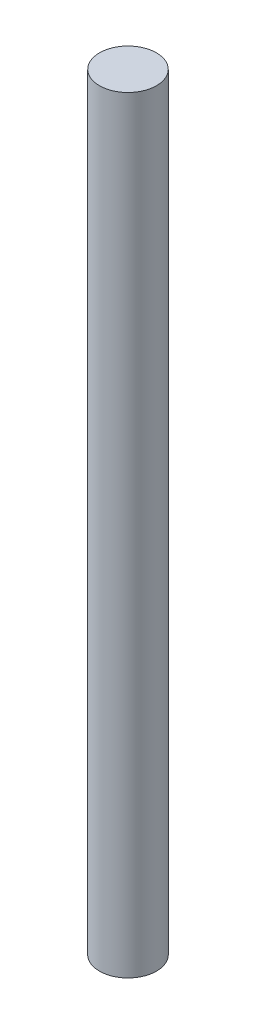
ISO-10303-21;
HEADER;
FILE_DESCRIPTION(('STEP AP214'),'2;1');
FILE_NAME('part.step','',(''),(''),'','','');
FILE_SCHEMA(('AUTOMOTIVE_DESIGN { 1 0 10303 214 1 1 1 1 }'));
ENDSEC;
DATA;
#1=APPLICATION_CONTEXT('core data for automotive mechanical design processes');
#2=APPLICATION_PROTOCOL_DEFINITION('international standard','automotive_design',2000,#1);
#3=PRODUCT_CONTEXT('',#1,'mechanical');
#4=PRODUCT('Part','Part','',(#3));
#5=PRODUCT_RELATED_PRODUCT_CATEGORY('part','',(#4));
#6=PRODUCT_DEFINITION_FORMATION('','',#4);
#7=PRODUCT_DEFINITION_CONTEXT('part definition',#1,'design');
#8=PRODUCT_DEFINITION('design','',#6,#7);
#9=PRODUCT_DEFINITION_SHAPE('','',#8);
#10=(LENGTH_UNIT() NAMED_UNIT(*) SI_UNIT(.MILLI.,.METRE.));
#11=(NAMED_UNIT(*) PLANE_ANGLE_UNIT() SI_UNIT($,.RADIAN.));
#12=(NAMED_UNIT(*) SI_UNIT($,.STERADIAN.) SOLID_ANGLE_UNIT());
#13=UNCERTAINTY_MEASURE_WITH_UNIT(LENGTH_MEASURE(1.E-05),#10,'distance_accuracy_value','');
#14=(GEOMETRIC_REPRESENTATION_CONTEXT(3) GLOBAL_UNCERTAINTY_ASSIGNED_CONTEXT((#13)) GLOBAL_UNIT_ASSIGNED_CONTEXT((#10,
#11,#12)) REPRESENTATION_CONTEXT('',''));
#15=CARTESIAN_POINT('',(0.,0.,0.));
#16=DIRECTION('',(0.,0.,1.));
#17=DIRECTION('',(1.,0.,0.));
#18=AXIS2_PLACEMENT_3D('',#15,#16,#17);
#19=CARTESIAN_POINT('',(0.,107.65,0.));
#20=DIRECTION('',(0.,-1.,0.));
#21=DIRECTION('',(0.,0.,-1.));
#22=AXIS2_PLACEMENT_3D('',#19,#20,#21);
#23=CYLINDRICAL_SURFACE('',#22,4.);
#24=CARTESIAN_POINT('',(0.,107.65,0.));
#25=DIRECTION('',(0.,1.,0.));
#26=DIRECTION('',(0.,0.,1.));
#27=AXIS2_PLACEMENT_3D('',#24,#25,#26);
#28=CIRCLE('',#27,4.);
#29=CARTESIAN_POINT('',(0.,107.65,4.));
#30=VERTEX_POINT('',#29);
#31=EDGE_CURVE('E10',#30,#30,#28,.T.);
#32=ORIENTED_EDGE('',*,*,#31,.F.);
#33=EDGE_LOOP('',(#32));
#34=FACE_BOUND('',#33,.T.);
#35=CARTESIAN_POINT('',(0.,0.,0.));
#36=DIRECTION('',(0.,1.,0.));
#37=DIRECTION('',(0.,0.,1.));
#38=AXIS2_PLACEMENT_3D('',#35,#36,#37);
#39=CIRCLE('',#38,4.);
#40=CARTESIAN_POINT('',(0.,0.,4.));
#41=VERTEX_POINT('',#40);
#42=EDGE_CURVE('E33',#41,#41,#39,.T.);
#43=ORIENTED_EDGE('',*,*,#42,.T.);
#44=EDGE_LOOP('',(#43));
#45=FACE_BOUND('',#44,.T.);
#46=ADVANCED_FACE('F30',(#34,#45),#23,.T.);
#47=CARTESIAN_POINT('',(0.,107.65,0.));
#48=DIRECTION('',(0.,1.,0.));
#49=DIRECTION('',(0.,0.,1.));
#50=AXIS2_PLACEMENT_3D('',#47,#48,#49);
#51=PLANE('',#50);
#52=ORIENTED_EDGE('',*,*,#31,.T.);
#53=EDGE_LOOP('',(#52));
#54=FACE_BOUND('',#53,.T.);
#55=ADVANCED_FACE('F45',(#54),#51,.T.);
#56=CARTESIAN_POINT('',(0.,0.,0.));
#57=DIRECTION('',(0.,1.,0.));
#58=DIRECTION('',(0.,0.,1.));
#59=AXIS2_PLACEMENT_3D('',#56,#57,#58);
#60=PLANE('',#59);
#61=ORIENTED_EDGE('',*,*,#42,.F.);
#62=EDGE_LOOP('',(#61));
#63=FACE_BOUND('',#62,.T.);
#64=ADVANCED_FACE('F43',(#63),#60,.F.);
#65=CLOSED_SHELL('',(#46,#55,#64));
#66=MANIFOLD_SOLID_BREP('B2',#65);
#67=ADVANCED_BREP_SHAPE_REPRESENTATION('',(#18,#66),#14);
#68=SHAPE_DEFINITION_REPRESENTATION(#9,#67);
ENDSEC;
END-ISO-10303-21;
